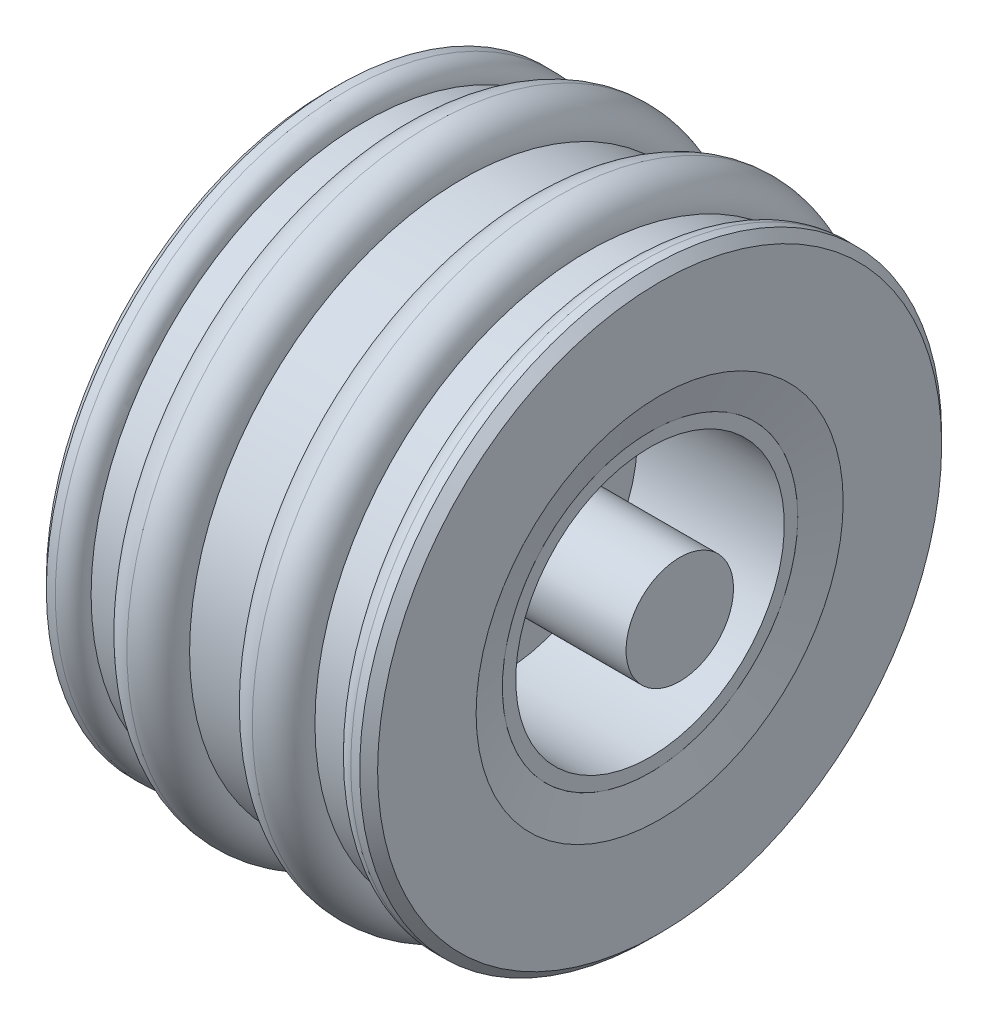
ISO-10303-21;
HEADER;
FILE_DESCRIPTION(('STEP AP214'),'2;1');
FILE_NAME('part.step','',(''),(''),'','','');
FILE_SCHEMA(('AUTOMOTIVE_DESIGN { 1 0 10303 214 1 1 1 1 }'));
ENDSEC;
DATA;
#1=APPLICATION_CONTEXT('core data for automotive mechanical design processes');
#2=APPLICATION_PROTOCOL_DEFINITION('international standard','automotive_design',2000,#1);
#3=PRODUCT_CONTEXT('',#1,'mechanical');
#4=PRODUCT('Part','Part','',(#3));
#5=PRODUCT_RELATED_PRODUCT_CATEGORY('part','',(#4));
#6=PRODUCT_DEFINITION_FORMATION('','',#4);
#7=PRODUCT_DEFINITION_CONTEXT('part definition',#1,'design');
#8=PRODUCT_DEFINITION('design','',#6,#7);
#9=PRODUCT_DEFINITION_SHAPE('','',#8);
#10=(LENGTH_UNIT() NAMED_UNIT(*) SI_UNIT(.MILLI.,.METRE.));
#11=(NAMED_UNIT(*) PLANE_ANGLE_UNIT() SI_UNIT($,.RADIAN.));
#12=(NAMED_UNIT(*) SI_UNIT($,.STERADIAN.) SOLID_ANGLE_UNIT());
#13=UNCERTAINTY_MEASURE_WITH_UNIT(LENGTH_MEASURE(1.E-05),#10,'distance_accuracy_value','');
#14=(GEOMETRIC_REPRESENTATION_CONTEXT(3) GLOBAL_UNCERTAINTY_ASSIGNED_CONTEXT((#13)) GLOBAL_UNIT_ASSIGNED_CONTEXT((#10,
#11,#12)) REPRESENTATION_CONTEXT('',''));
#15=CARTESIAN_POINT('',(0.,0.,0.));
#16=DIRECTION('',(0.,0.,1.));
#17=DIRECTION('',(1.,0.,0.));
#18=AXIS2_PLACEMENT_3D('',#15,#16,#17);
#19=CARTESIAN_POINT('',(174.282032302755,150.,0.));
#20=DIRECTION('',(-1.,0.,0.));
#21=DIRECTION('',(0.,-1.,0.));
#22=AXIS2_PLACEMENT_3D('',#19,#20,#21);
#23=PLANE('',#22);
#24=CARTESIAN_POINT('',(174.282032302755,0.,0.));
#25=DIRECTION('',(-1.,0.,0.));
#26=DIRECTION('',(0.,-1.,0.));
#27=AXIS2_PLACEMENT_3D('',#24,#25,#26);
#28=CIRCLE('',#27,165.);
#29=CARTESIAN_POINT('',(174.282032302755,-165.,0.));
#30=VERTEX_POINT('',#29);
#31=EDGE_CURVE('E63',#30,#30,#28,.T.);
#32=ORIENTED_EDGE('',*,*,#31,.F.);
#33=EDGE_LOOP('',(#32));
#34=FACE_BOUND('',#33,.T.);
#35=CARTESIAN_POINT('',(174.282032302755,0.,0.));
#36=DIRECTION('',(-1.,0.,0.));
#37=DIRECTION('',(0.,-1.,0.));
#38=AXIS2_PLACEMENT_3D('',#35,#36,#37);
#39=CIRCLE('',#38,150.);
#40=CARTESIAN_POINT('',(174.282032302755,-150.,0.));
#41=VERTEX_POINT('',#40);
#42=EDGE_CURVE('E58',#41,#41,#39,.T.);
#43=ORIENTED_EDGE('',*,*,#42,.T.);
#44=EDGE_LOOP('',(#43));
#45=FACE_BOUND('',#44,.T.);
#46=ADVANCED_FACE('F47',(#34,#45),#23,.F.);
#47=CARTESIAN_POINT('',(-10.,0.,0.));
#48=DIRECTION('',(-1.,0.,0.));
#49=DIRECTION('',(0.,-1.,0.));
#50=AXIS2_PLACEMENT_3D('',#47,#48,#49);
#51=CYLINDRICAL_SURFACE('',#50,150.);
#52=ORIENTED_EDGE('',*,*,#42,.F.);
#53=EDGE_LOOP('',(#52));
#54=FACE_BOUND('',#53,.T.);
#55=CARTESIAN_POINT('',(9.99999999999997,0.,0.));
#56=DIRECTION('',(-1.,0.,0.));
#57=DIRECTION('',(0.,-1.,0.));
#58=AXIS2_PLACEMENT_3D('',#55,#56,#57);
#59=CIRCLE('',#58,150.);
#60=CARTESIAN_POINT('',(10.,-150.,0.));
#61=VERTEX_POINT('',#60);
#62=EDGE_CURVE('E76',#61,#61,#59,.T.);
#63=ORIENTED_EDGE('',*,*,#62,.T.);
#64=EDGE_LOOP('',(#63));
#65=FACE_BOUND('',#64,.T.);
#66=ADVANCED_FACE('F82',(#54,#65),#51,.F.);
#67=CARTESIAN_POINT('',(9.99999999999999,0.,0.));
#68=DIRECTION('',(-1.,0.,0.));
#69=DIRECTION('',(0.,-1.,0.));
#70=AXIS2_PLACEMENT_3D('',#67,#68,#69);
#71=PLANE('',#70);
#72=CARTESIAN_POINT('',(9.99999999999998,0.,0.));
#73=DIRECTION('',(-1.,0.,0.));
#74=DIRECTION('',(0.,-1.,0.));
#75=AXIS2_PLACEMENT_3D('',#72,#73,#74);
#76=CIRCLE('',#75,60.);
#77=CARTESIAN_POINT('',(9.99999999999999,-60.,0.));
#78=VERTEX_POINT('',#77);
#79=EDGE_CURVE('E11',#78,#78,#76,.F.);
#80=ORIENTED_EDGE('',*,*,#79,.F.);
#81=EDGE_LOOP('',(#80));
#82=FACE_BOUND('',#81,.T.);
#83=ORIENTED_EDGE('',*,*,#62,.F.);
#84=EDGE_LOOP('',(#83));
#85=FACE_BOUND('',#84,.T.);
#86=ADVANCED_FACE('F85',(#82,#85),#71,.F.);
#87=CARTESIAN_POINT('',(-9.99999999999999,0.,0.));
#88=DIRECTION('',(1.,0.,0.));
#89=DIRECTION('',(0.,1.,0.));
#90=AXIS2_PLACEMENT_3D('',#87,#88,#89);
#91=PLANE('',#90);
#92=CARTESIAN_POINT('',(-9.99999999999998,0.,0.));
#93=DIRECTION('',(1.,0.,0.));
#94=DIRECTION('',(0.,1.,0.));
#95=AXIS2_PLACEMENT_3D('',#92,#93,#94);
#96=CIRCLE('',#95,60.);
#97=CARTESIAN_POINT('',(-9.99999999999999,60.,0.));
#98=VERTEX_POINT('',#97);
#99=EDGE_CURVE('E50',#98,#98,#96,.F.);
#100=ORIENTED_EDGE('',*,*,#99,.F.);
#101=EDGE_LOOP('',(#100));
#102=FACE_BOUND('',#101,.T.);
#103=CARTESIAN_POINT('',(-9.99999999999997,0.,0.));
#104=DIRECTION('',(-1.,0.,0.));
#105=DIRECTION('',(0.,-1.,0.));
#106=AXIS2_PLACEMENT_3D('',#103,#104,#105);
#107=CIRCLE('',#106,150.);
#108=CARTESIAN_POINT('',(-9.99999999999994,-150.,0.));
#109=VERTEX_POINT('',#108);
#110=EDGE_CURVE('E73',#109,#109,#107,.T.);
#111=ORIENTED_EDGE('',*,*,#110,.T.);
#112=EDGE_LOOP('',(#111));
#113=FACE_BOUND('',#112,.T.);
#114=ADVANCED_FACE('F89',(#102,#113),#91,.F.);
#115=CARTESIAN_POINT('',(-10.,0.,0.));
#116=DIRECTION('',(-1.,0.,0.));
#117=DIRECTION('',(0.,-1.,0.));
#118=AXIS2_PLACEMENT_3D('',#115,#116,#117);
#119=CYLINDRICAL_SURFACE('',#118,150.);
#120=ORIENTED_EDGE('',*,*,#110,.F.);
#121=EDGE_LOOP('',(#120));
#122=FACE_BOUND('',#121,.T.);
#123=CARTESIAN_POINT('',(-174.282032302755,0.,0.));
#124=DIRECTION('',(-1.,0.,0.));
#125=DIRECTION('',(0.,-1.,0.));
#126=AXIS2_PLACEMENT_3D('',#123,#124,#125);
#127=CIRCLE('',#126,150.);
#128=CARTESIAN_POINT('',(-174.282032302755,-150.,0.));
#129=VERTEX_POINT('',#128);
#130=EDGE_CURVE('E70',#129,#129,#127,.T.);
#131=ORIENTED_EDGE('',*,*,#130,.T.);
#132=EDGE_LOOP('',(#131));
#133=FACE_BOUND('',#132,.T.);
#134=ADVANCED_FACE('F95',(#122,#133),#119,.F.);
#135=CARTESIAN_POINT('',(-174.282032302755,150.,0.));
#136=DIRECTION('',(1.,0.,0.));
#137=DIRECTION('',(0.,1.,0.));
#138=AXIS2_PLACEMENT_3D('',#135,#136,#137);
#139=PLANE('',#138);
#140=ORIENTED_EDGE('',*,*,#130,.F.);
#141=EDGE_LOOP('',(#140));
#142=FACE_BOUND('',#141,.T.);
#143=CARTESIAN_POINT('',(-174.282032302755,0.,0.));
#144=DIRECTION('',(-1.,0.,0.));
#145=DIRECTION('',(0.,-1.,0.));
#146=AXIS2_PLACEMENT_3D('',#143,#144,#145);
#147=CIRCLE('',#146,165.);
#148=CARTESIAN_POINT('',(-174.282032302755,-165.,0.));
#149=VERTEX_POINT('',#148);
#150=EDGE_CURVE('E66',#149,#149,#147,.T.);
#151=ORIENTED_EDGE('',*,*,#150,.T.);
#152=EDGE_LOOP('',(#151));
#153=FACE_BOUND('',#152,.T.);
#154=ADVANCED_FACE('F107',(#142,#153),#139,.F.);
#155=CARTESIAN_POINT('',(-10.,0.,0.));
#156=DIRECTION('',(-1.,0.,0.));
#157=DIRECTION('',(0.,-1.,0.));
#158=AXIS2_PLACEMENT_3D('',#155,#156,#157);
#159=CYLINDRICAL_SURFACE('',#158,165.);
#160=ORIENTED_EDGE('',*,*,#150,.F.);
#161=EDGE_LOOP('',(#160));
#162=FACE_BOUND('',#161,.T.);
#163=ORIENTED_EDGE('',*,*,#31,.T.);
#164=EDGE_LOOP('',(#163));
#165=FACE_BOUND('',#164,.T.);
#166=ADVANCED_FACE('F104',(#162,#165),#159,.T.);
#167=CARTESIAN_POINT('',(-207.5,0.,0.));
#168=DIRECTION('',(1.,0.,0.));
#169=DIRECTION('',(0.,0.,-1.));
#170=AXIS2_PLACEMENT_3D('',#167,#168,#169);
#171=PLANE('',#170);
#172=CARTESIAN_POINT('',(-207.5,0.,0.));
#173=DIRECTION('',(1.,0.,0.));
#174=DIRECTION('',(0.,0.,-1.));
#175=AXIS2_PLACEMENT_3D('',#172,#173,#174);
#176=CIRCLE('',#175,60.);
#177=CARTESIAN_POINT('',(-207.5,0.,-60.));
#178=VERTEX_POINT('',#177);
#179=EDGE_CURVE('E61',#178,#178,#176,.T.);
#180=ORIENTED_EDGE('',*,*,#179,.F.);
#181=EDGE_LOOP('',(#180));
#182=FACE_BOUND('',#181,.T.);
#183=ADVANCED_FACE('F106',(#182),#171,.F.);
#184=CARTESIAN_POINT('',(207.5,0.,0.));
#185=DIRECTION('',(-1.,0.,0.));
#186=DIRECTION('',(0.,0.,1.));
#187=AXIS2_PLACEMENT_3D('',#184,#185,#186);
#188=CYLINDRICAL_SURFACE('',#187,60.);
#189=ORIENTED_EDGE('',*,*,#179,.T.);
#190=EDGE_LOOP('',(#189));
#191=FACE_BOUND('',#190,.T.);
#192=ORIENTED_EDGE('',*,*,#99,.T.);
#193=EDGE_LOOP('',(#192));
#194=FACE_BOUND('',#193,.T.);
#195=ADVANCED_FACE('F114',(#191,#194),#188,.T.);
#196=CARTESIAN_POINT('',(207.5,0.,0.));
#197=DIRECTION('',(1.,0.,0.));
#198=DIRECTION('',(0.,0.,-1.));
#199=AXIS2_PLACEMENT_3D('',#196,#197,#198);
#200=CIRCLE('',#199,60.);
#201=CARTESIAN_POINT('',(207.5,0.,-60.));
#202=VERTEX_POINT('',#201);
#203=EDGE_CURVE('E67',#202,#202,#200,.T.);
#204=ORIENTED_EDGE('',*,*,#203,.F.);
#205=EDGE_LOOP('',(#204));
#206=FACE_BOUND('',#205,.T.);
#207=ORIENTED_EDGE('',*,*,#79,.T.);
#208=EDGE_LOOP('',(#207));
#209=FACE_BOUND('',#208,.T.);
#210=ADVANCED_FACE('F121',(#206,#209),#188,.T.);
#211=CARTESIAN_POINT('',(207.5,0.,0.));
#212=DIRECTION('',(1.,0.,0.));
#213=DIRECTION('',(0.,0.,-1.));
#214=AXIS2_PLACEMENT_3D('',#211,#212,#213);
#215=PLANE('',#214);
#216=ORIENTED_EDGE('',*,*,#203,.T.);
#217=EDGE_LOOP('',(#216));
#218=FACE_BOUND('',#217,.T.);
#219=ADVANCED_FACE('F181',(#218),#215,.T.);
#220=CLOSED_SHELL('',(#46,#66,#86,#114,#134,#154,#166,#183,#195,#210,#219));
#221=MANIFOLD_SOLID_BREP('B2',#220);
#222=CARTESIAN_POINT('',(0.,0.,0.));
#223=DIRECTION('',(1.,0.,0.));
#224=DIRECTION('',(0.,0.,-1.));
#225=AXIS2_PLACEMENT_3D('',#222,#223,#224);
#226=CYLINDRICAL_SURFACE('',#225,305.);
#227=CARTESIAN_POINT('',(-145.,0.,0.));
#228=DIRECTION('',(1.,0.,0.));
#229=DIRECTION('',(0.,0.,-1.));
#230=AXIS2_PLACEMENT_3D('',#227,#228,#229);
#231=CIRCLE('',#230,305.);
#232=CARTESIAN_POINT('',(-145.,0.,-305.));
#233=VERTEX_POINT('',#232);
#234=EDGE_CURVE('E279',#233,#233,#231,.T.);
#235=ORIENTED_EDGE('',*,*,#234,.T.);
#236=EDGE_LOOP('',(#235));
#237=FACE_BOUND('',#236,.T.);
#238=CARTESIAN_POINT('',(-105.,0.,0.));
#239=DIRECTION('',(1.,0.,0.));
#240=DIRECTION('',(0.,0.,-1.));
#241=AXIS2_PLACEMENT_3D('',#238,#239,#240);
#242=CIRCLE('',#241,305.);
#243=CARTESIAN_POINT('',(-105.,0.,-305.));
#244=VERTEX_POINT('',#243);
#245=EDGE_CURVE('E276',#244,#244,#242,.T.);
#246=ORIENTED_EDGE('',*,*,#245,.F.);
#247=EDGE_LOOP('',(#246));
#248=FACE_BOUND('',#247,.T.);
#249=ADVANCED_FACE('F230',(#237,#248),#226,.T.);
#250=CARTESIAN_POINT('',(0.,0.,0.));
#251=DIRECTION('',(1.,0.,0.));
#252=DIRECTION('',(0.,0.,-1.));
#253=AXIS2_PLACEMENT_3D('',#250,#251,#252);
#254=CYLINDRICAL_SURFACE('',#253,325.);
#255=CARTESIAN_POINT('',(-165.,0.,0.));
#256=DIRECTION('',(1.,0.,0.));
#257=DIRECTION('',(0.,0.,-1.));
#258=AXIS2_PLACEMENT_3D('',#255,#256,#257);
#259=CIRCLE('',#258,325.);
#260=CARTESIAN_POINT('',(-165.,0.,-325.));
#261=VERTEX_POINT('',#260);
#262=EDGE_CURVE('E238',#261,#261,#259,.F.);
#263=ORIENTED_EDGE('',*,*,#262,.T.);
#264=EDGE_LOOP('',(#263));
#265=FACE_BOUND('',#264,.T.);
#266=CARTESIAN_POINT('',(-175.,0.,0.));
#267=DIRECTION('',(-1.,0.,0.));
#268=DIRECTION('',(0.,0.,1.));
#269=AXIS2_PLACEMENT_3D('',#266,#267,#268);
#270=CIRCLE('',#269,325.);
#271=CARTESIAN_POINT('',(-175.,0.,325.));
#272=VERTEX_POINT('',#271);
#273=EDGE_CURVE('E261',#272,#272,#270,.F.);
#274=ORIENTED_EDGE('',*,*,#273,.T.);
#275=EDGE_LOOP('',(#274));
#276=FACE_BOUND('',#275,.T.);
#277=ADVANCED_FACE('F355',(#265,#276),#254,.T.);
#278=CARTESIAN_POINT('',(-185.,165.,0.));
#279=DIRECTION('',(-1.,0.,0.));
#280=DIRECTION('',(0.,0.,1.));
#281=AXIS2_PLACEMENT_3D('',#278,#279,#280);
#282=PLANE('',#281);
#283=CARTESIAN_POINT('',(-185.,0.,0.));
#284=DIRECTION('',(-1.,0.,0.));
#285=DIRECTION('',(0.,0.,1.));
#286=AXIS2_PLACEMENT_3D('',#283,#284,#285);
#287=CIRCLE('',#286,315.);
#288=CARTESIAN_POINT('',(-185.,0.,315.));
#289=VERTEX_POINT('',#288);
#290=EDGE_CURVE('E258',#289,#289,#287,.T.);
#291=ORIENTED_EDGE('',*,*,#290,.T.);
#292=EDGE_LOOP('',(#291));
#293=FACE_BOUND('',#292,.T.);
#294=CARTESIAN_POINT('',(-185.,0.,0.));
#295=DIRECTION('',(-1.,0.,0.));
#296=DIRECTION('',(0.,0.,1.));
#297=AXIS2_PLACEMENT_3D('',#294,#295,#296);
#298=CIRCLE('',#297,205.);
#299=CARTESIAN_POINT('',(-185.,0.,205.));
#300=VERTEX_POINT('',#299);
#301=EDGE_CURVE('E273',#300,#300,#298,.F.);
#302=ORIENTED_EDGE('',*,*,#301,.T.);
#303=EDGE_LOOP('',(#302));
#304=FACE_BOUND('',#303,.T.);
#305=ADVANCED_FACE('F351',(#293,#304),#282,.T.);
#306=CARTESIAN_POINT('',(0.,0.,0.));
#307=DIRECTION('',(1.,0.,0.));
#308=DIRECTION('',(0.,0.,-1.));
#309=AXIS2_PLACEMENT_3D('',#306,#307,#308);
#310=CYLINDRICAL_SURFACE('',#309,165.);
#311=CARTESIAN_POINT('',(-174.282032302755,0.,0.));
#312=DIRECTION('',(-1.,0.,0.));
#313=DIRECTION('',(0.,0.,1.));
#314=AXIS2_PLACEMENT_3D('',#311,#312,#313);
#315=CIRCLE('',#314,165.);
#316=CARTESIAN_POINT('',(-174.282032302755,0.,165.));
#317=VERTEX_POINT('',#316);
#318=EDGE_CURVE('E267',#317,#317,#315,.T.);
#319=ORIENTED_EDGE('',*,*,#318,.T.);
#320=EDGE_LOOP('',(#319));
#321=FACE_BOUND('',#320,.T.);
#322=CARTESIAN_POINT('',(174.282032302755,0.,0.));
#323=DIRECTION('',(1.,0.,0.));
#324=DIRECTION('',(0.,0.,-1.));
#325=AXIS2_PLACEMENT_3D('',#322,#323,#324);
#326=CIRCLE('',#325,165.);
#327=CARTESIAN_POINT('',(174.282032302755,0.,-165.));
#328=VERTEX_POINT('',#327);
#329=EDGE_CURVE('E270',#328,#328,#326,.T.);
#330=ORIENTED_EDGE('',*,*,#329,.T.);
#331=EDGE_LOOP('',(#330));
#332=FACE_BOUND('',#331,.T.);
#333=ADVANCED_FACE('F347',(#321,#332),#310,.F.);
#334=CARTESIAN_POINT('',(185.,325.,0.));
#335=DIRECTION('',(1.,0.,0.));
#336=DIRECTION('',(0.,0.,-1.));
#337=AXIS2_PLACEMENT_3D('',#334,#335,#336);
#338=PLANE('',#337);
#339=CARTESIAN_POINT('',(185.,0.,0.));
#340=DIRECTION('',(1.,0.,0.));
#341=DIRECTION('',(0.,0.,-1.));
#342=AXIS2_PLACEMENT_3D('',#339,#340,#341);
#343=CIRCLE('',#342,315.);
#344=CARTESIAN_POINT('',(185.,0.,-315.));
#345=VERTEX_POINT('',#344);
#346=EDGE_CURVE('E246',#345,#345,#343,.T.);
#347=ORIENTED_EDGE('',*,*,#346,.T.);
#348=EDGE_LOOP('',(#347));
#349=FACE_BOUND('',#348,.T.);
#350=CARTESIAN_POINT('',(185.,0.,0.));
#351=DIRECTION('',(1.,0.,0.));
#352=DIRECTION('',(0.,0.,-1.));
#353=AXIS2_PLACEMENT_3D('',#350,#351,#352);
#354=CIRCLE('',#353,205.);
#355=CARTESIAN_POINT('',(185.,0.,-205.));
#356=VERTEX_POINT('',#355);
#357=EDGE_CURVE('E264',#356,#356,#354,.F.);
#358=ORIENTED_EDGE('',*,*,#357,.T.);
#359=EDGE_LOOP('',(#358));
#360=FACE_BOUND('',#359,.T.);
#361=ADVANCED_FACE('F344',(#349,#360),#338,.T.);
#362=CARTESIAN_POINT('',(0.,0.,0.));
#363=DIRECTION('',(1.,0.,0.));
#364=DIRECTION('',(0.,0.,-1.));
#365=AXIS2_PLACEMENT_3D('',#362,#363,#364);
#366=CYLINDRICAL_SURFACE('',#365,325.);
#367=CARTESIAN_POINT('',(165.,0.,0.));
#368=DIRECTION('',(-1.,0.,0.));
#369=DIRECTION('',(0.,0.,1.));
#370=AXIS2_PLACEMENT_3D('',#367,#368,#369);
#371=CIRCLE('',#370,325.);
#372=CARTESIAN_POINT('',(165.,0.,325.));
#373=VERTEX_POINT('',#372);
#374=EDGE_CURVE('E46',#373,#373,#371,.F.);
#375=ORIENTED_EDGE('',*,*,#374,.T.);
#376=EDGE_LOOP('',(#375));
#377=FACE_BOUND('',#376,.T.);
#378=CARTESIAN_POINT('',(175.,0.,0.));
#379=DIRECTION('',(1.,0.,0.));
#380=DIRECTION('',(0.,0.,-1.));
#381=AXIS2_PLACEMENT_3D('',#378,#379,#380);
#382=CIRCLE('',#381,325.);
#383=CARTESIAN_POINT('',(175.,0.,-325.));
#384=VERTEX_POINT('',#383);
#385=EDGE_CURVE('E242',#384,#384,#382,.F.);
#386=ORIENTED_EDGE('',*,*,#385,.T.);
#387=EDGE_LOOP('',(#386));
#388=FACE_BOUND('',#387,.T.);
#389=ADVANCED_FACE('F340',(#377,#388),#366,.T.);
#390=CARTESIAN_POINT('',(0.,0.,0.));
#391=DIRECTION('',(1.,0.,0.));
#392=DIRECTION('',(0.,0.,-1.));
#393=AXIS2_PLACEMENT_3D('',#390,#391,#392);
#394=CYLINDRICAL_SURFACE('',#393,305.);
#395=CARTESIAN_POINT('',(105.,0.,0.));
#396=DIRECTION('',(1.,0.,0.));
#397=DIRECTION('',(0.,0.,-1.));
#398=AXIS2_PLACEMENT_3D('',#395,#396,#397);
#399=CIRCLE('',#398,305.);
#400=CARTESIAN_POINT('',(105.,0.,-305.));
#401=VERTEX_POINT('',#400);
#402=EDGE_CURVE('E285',#401,#401,#399,.T.);
#403=ORIENTED_EDGE('',*,*,#402,.T.);
#404=EDGE_LOOP('',(#403));
#405=FACE_BOUND('',#404,.T.);
#406=CARTESIAN_POINT('',(145.,0.,0.));
#407=DIRECTION('',(1.,0.,0.));
#408=DIRECTION('',(0.,0.,-1.));
#409=AXIS2_PLACEMENT_3D('',#406,#407,#408);
#410=CIRCLE('',#409,305.);
#411=CARTESIAN_POINT('',(145.,0.,-305.));
#412=VERTEX_POINT('',#411);
#413=EDGE_CURVE('E282',#412,#412,#410,.T.);
#414=ORIENTED_EDGE('',*,*,#413,.F.);
#415=EDGE_LOOP('',(#414));
#416=FACE_BOUND('',#415,.T.);
#417=ADVANCED_FACE('F336',(#405,#416),#394,.T.);
#418=CARTESIAN_POINT('',(0.,0.,0.));
#419=DIRECTION('',(1.,0.,0.));
#420=DIRECTION('',(0.,0.,-1.));
#421=AXIS2_PLACEMENT_3D('',#418,#419,#420);
#422=CYLINDRICAL_SURFACE('',#421,305.);
#423=CARTESIAN_POINT('',(-35.0000000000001,0.,0.));
#424=DIRECTION('',(1.,0.,0.));
#425=DIRECTION('',(0.,0.,-1.));
#426=AXIS2_PLACEMENT_3D('',#423,#424,#425);
#427=CIRCLE('',#426,305.);
#428=CARTESIAN_POINT('',(-35.0000000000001,0.,-305.));
#429=VERTEX_POINT('',#428);
#430=EDGE_CURVE('E291',#429,#429,#427,.T.);
#431=ORIENTED_EDGE('',*,*,#430,.T.);
#432=EDGE_LOOP('',(#431));
#433=FACE_BOUND('',#432,.T.);
#434=CARTESIAN_POINT('',(35.,0.,0.));
#435=DIRECTION('',(1.,0.,0.));
#436=DIRECTION('',(0.,0.,-1.));
#437=AXIS2_PLACEMENT_3D('',#434,#435,#436);
#438=CIRCLE('',#437,305.);
#439=CARTESIAN_POINT('',(35.,0.,-305.));
#440=VERTEX_POINT('',#439);
#441=EDGE_CURVE('E288',#440,#440,#438,.T.);
#442=ORIENTED_EDGE('',*,*,#441,.F.);
#443=EDGE_LOOP('',(#442));
#444=FACE_BOUND('',#443,.T.);
#445=ADVANCED_FACE('F332',(#433,#444),#422,.T.);
#446=CARTESIAN_POINT('',(-185.,0.,0.));
#447=DIRECTION('',(-1.,0.,0.));
#448=DIRECTION('',(0.,0.,1.));
#449=AXIS2_PLACEMENT_3D('',#446,#447,#448);
#450=CONICAL_SURFACE('',#449,205.,1.30899693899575);
#451=ORIENTED_EDGE('',*,*,#318,.F.);
#452=EDGE_LOOP('',(#451));
#453=FACE_BOUND('',#452,.T.);
#454=ORIENTED_EDGE('',*,*,#301,.F.);
#455=EDGE_LOOP('',(#454));
#456=FACE_BOUND('',#455,.T.);
#457=ADVANCED_FACE('F335',(#453,#456),#450,.F.);
#458=CARTESIAN_POINT('',(174.282032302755,0.,0.));
#459=DIRECTION('',(1.,0.,0.));
#460=DIRECTION('',(0.,0.,-1.));
#461=AXIS2_PLACEMENT_3D('',#458,#459,#460);
#462=CONICAL_SURFACE('',#461,165.,1.30899693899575);
#463=ORIENTED_EDGE('',*,*,#357,.F.);
#464=EDGE_LOOP('',(#463));
#465=FACE_BOUND('',#464,.T.);
#466=ORIENTED_EDGE('',*,*,#329,.F.);
#467=EDGE_LOOP('',(#466));
#468=FACE_BOUND('',#467,.T.);
#469=ADVANCED_FACE('F368',(#465,#468),#462,.F.);
#470=CARTESIAN_POINT('',(-175.,0.,0.));
#471=DIRECTION('',(1.,0.,0.));
#472=DIRECTION('',(0.,0.,-1.));
#473=AXIS2_PLACEMENT_3D('',#470,#471,#472);
#474=CONICAL_SURFACE('',#473,325.,0.785398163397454);
#475=ORIENTED_EDGE('',*,*,#290,.F.);
#476=EDGE_LOOP('',(#475));
#477=FACE_BOUND('',#476,.T.);
#478=ORIENTED_EDGE('',*,*,#273,.F.);
#479=EDGE_LOOP('',(#478));
#480=FACE_BOUND('',#479,.T.);
#481=ADVANCED_FACE('F375',(#477,#480),#474,.T.);
#482=CARTESIAN_POINT('',(185.,0.,0.));
#483=DIRECTION('',(-1.,0.,0.));
#484=DIRECTION('',(0.,0.,1.));
#485=AXIS2_PLACEMENT_3D('',#482,#483,#484);
#486=CONICAL_SURFACE('',#485,315.,0.785398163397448);
#487=ORIENTED_EDGE('',*,*,#385,.F.);
#488=EDGE_LOOP('',(#487));
#489=FACE_BOUND('',#488,.T.);
#490=ORIENTED_EDGE('',*,*,#346,.F.);
#491=EDGE_LOOP('',(#490));
#492=FACE_BOUND('',#491,.T.);
#493=ADVANCED_FACE('F382',(#489,#492),#486,.T.);
#494=CARTESIAN_POINT('',(-70.0000000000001,0.,0.));
#495=DIRECTION('',(1.,0.,0.));
#496=DIRECTION('',(0.,0.,-1.));
#497=AXIS2_PLACEMENT_3D('',#494,#495,#496);
#498=TOROIDAL_SURFACE('',#497,305.,35.);
#499=ORIENTED_EDGE('',*,*,#430,.F.);
#500=EDGE_LOOP('',(#499));
#501=FACE_BOUND('',#500,.T.);
#502=CARTESIAN_POINT('',(-70.0000000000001,0.,0.));
#503=DIRECTION('',(1.,0.,0.));
#504=DIRECTION('',(0.,0.,-1.));
#505=AXIS2_PLACEMENT_3D('',#502,#503,#504);
#506=CIRCLE('',#505,340.);
#507=CARTESIAN_POINT('',(-70.0000000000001,0.,-340.));
#508=VERTEX_POINT('',#507);
#509=EDGE_CURVE('E252',#508,#508,#506,.F.);
#510=ORIENTED_EDGE('',*,*,#509,.F.);
#511=EDGE_LOOP('',(#510));
#512=FACE_BOUND('',#511,.T.);
#513=ADVANCED_FACE('F388',(#501,#512),#498,.T.);
#514=CARTESIAN_POINT('',(-70.0000000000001,0.,0.));
#515=DIRECTION('',(-1.,0.,0.));
#516=DIRECTION('',(0.,0.,1.));
#517=AXIS2_PLACEMENT_3D('',#514,#515,#516);
#518=TOROIDAL_SURFACE('',#517,305.,35.);
#519=ORIENTED_EDGE('',*,*,#245,.T.);
#520=EDGE_LOOP('',(#519));
#521=FACE_BOUND('',#520,.T.);
#522=ORIENTED_EDGE('',*,*,#509,.T.);
#523=EDGE_LOOP('',(#522));
#524=FACE_BOUND('',#523,.T.);
#525=ADVANCED_FACE('F390',(#521,#524),#518,.T.);
#526=CARTESIAN_POINT('',(70.,0.,0.));
#527=DIRECTION('',(-1.,0.,0.));
#528=DIRECTION('',(0.,0.,1.));
#529=AXIS2_PLACEMENT_3D('',#526,#527,#528);
#530=TOROIDAL_SURFACE('',#529,305.,35.);
#531=ORIENTED_EDGE('',*,*,#441,.T.);
#532=EDGE_LOOP('',(#531));
#533=FACE_BOUND('',#532,.T.);
#534=CARTESIAN_POINT('',(70.,0.,0.));
#535=DIRECTION('',(-1.,0.,0.));
#536=DIRECTION('',(0.,0.,1.));
#537=AXIS2_PLACEMENT_3D('',#534,#535,#536);
#538=CIRCLE('',#537,340.);
#539=CARTESIAN_POINT('',(70.,0.,340.));
#540=VERTEX_POINT('',#539);
#541=EDGE_CURVE('E249',#540,#540,#538,.F.);
#542=ORIENTED_EDGE('',*,*,#541,.F.);
#543=EDGE_LOOP('',(#542));
#544=FACE_BOUND('',#543,.T.);
#545=ADVANCED_FACE('F393',(#533,#544),#530,.T.);
#546=CARTESIAN_POINT('',(70.,0.,0.));
#547=DIRECTION('',(1.,0.,0.));
#548=DIRECTION('',(0.,0.,-1.));
#549=AXIS2_PLACEMENT_3D('',#546,#547,#548);
#550=TOROIDAL_SURFACE('',#549,305.,35.);
#551=ORIENTED_EDGE('',*,*,#541,.T.);
#552=EDGE_LOOP('',(#551));
#553=FACE_BOUND('',#552,.T.);
#554=ORIENTED_EDGE('',*,*,#402,.F.);
#555=EDGE_LOOP('',(#554));
#556=FACE_BOUND('',#555,.T.);
#557=ADVANCED_FACE('F398',(#553,#556),#550,.T.);
#558=CARTESIAN_POINT('',(-165.,0.,0.));
#559=DIRECTION('',(1.,0.,0.));
#560=DIRECTION('',(0.,0.,-1.));
#561=AXIS2_PLACEMENT_3D('',#558,#559,#560);
#562=TOROIDAL_SURFACE('',#561,305.,20.);
#563=ORIENTED_EDGE('',*,*,#262,.F.);
#564=EDGE_LOOP('',(#563));
#565=FACE_BOUND('',#564,.T.);
#566=ORIENTED_EDGE('',*,*,#234,.F.);
#567=EDGE_LOOP('',(#566));
#568=FACE_BOUND('',#567,.T.);
#569=ADVANCED_FACE('F401',(#565,#568),#562,.T.);
#570=CARTESIAN_POINT('',(165.,0.,0.));
#571=DIRECTION('',(-1.,0.,0.));
#572=DIRECTION('',(0.,0.,1.));
#573=AXIS2_PLACEMENT_3D('',#570,#571,#572);
#574=TOROIDAL_SURFACE('',#573,305.,20.);
#575=ORIENTED_EDGE('',*,*,#413,.T.);
#576=EDGE_LOOP('',(#575));
#577=FACE_BOUND('',#576,.T.);
#578=ORIENTED_EDGE('',*,*,#374,.F.);
#579=EDGE_LOOP('',(#578));
#580=FACE_BOUND('',#579,.T.);
#581=ADVANCED_FACE('F232',(#577,#580),#574,.T.);
#582=CLOSED_SHELL('',(#249,#277,#305,#333,#361,#389,#417,#445,#457,#469,#481,#493,#513,#525,
#545,#557,#569,#581));
#583=CARTESIAN_POINT('',(165.,185.,0.));
#584=DIRECTION('',(1.,0.,0.));
#585=DIRECTION('',(0.,0.,-1.));
#586=AXIS2_PLACEMENT_3D('',#583,#584,#585);
#587=PLANE('',#586);
#588=CARTESIAN_POINT('',(165.,0.,0.));
#589=DIRECTION('',(1.,0.,0.));
#590=DIRECTION('',(0.,0.,-1.));
#591=AXIS2_PLACEMENT_3D('',#588,#589,#590);
#592=CIRCLE('',#591,275.);
#593=CARTESIAN_POINT('',(165.,0.,-275.));
#594=VERTEX_POINT('',#593);
#595=EDGE_CURVE('E254',#594,#594,#592,.T.);
#596=ORIENTED_EDGE('',*,*,#595,.F.);
#597=EDGE_LOOP('',(#596));
#598=FACE_BOUND('',#597,.T.);
#599=CARTESIAN_POINT('',(165.,0.,0.));
#600=DIRECTION('',(1.,0.,0.));
#601=DIRECTION('',(0.,0.,-1.));
#602=AXIS2_PLACEMENT_3D('',#599,#600,#601);
#603=CIRCLE('',#602,185.);
#604=CARTESIAN_POINT('',(165.,0.,-185.));
#605=VERTEX_POINT('',#604);
#606=EDGE_CURVE('E294',#605,#605,#603,.T.);
#607=ORIENTED_EDGE('',*,*,#606,.T.);
#608=EDGE_LOOP('',(#607));
#609=FACE_BOUND('',#608,.T.);
#610=ADVANCED_FACE('F308',(#598,#609),#587,.F.);
#611=CARTESIAN_POINT('',(0.,0.,0.));
#612=DIRECTION('',(1.,0.,0.));
#613=DIRECTION('',(0.,0.,-1.));
#614=AXIS2_PLACEMENT_3D('',#611,#612,#613);
#615=CYLINDRICAL_SURFACE('',#614,185.);
#616=ORIENTED_EDGE('',*,*,#606,.F.);
#617=EDGE_LOOP('',(#616));
#618=FACE_BOUND('',#617,.T.);
#619=CARTESIAN_POINT('',(-165.,0.,0.));
#620=DIRECTION('',(1.,0.,0.));
#621=DIRECTION('',(0.,0.,-1.));
#622=AXIS2_PLACEMENT_3D('',#619,#620,#621);
#623=CIRCLE('',#622,185.);
#624=CARTESIAN_POINT('',(-165.,0.,-185.));
#625=VERTEX_POINT('',#624);
#626=EDGE_CURVE('E297',#625,#625,#623,.T.);
#627=ORIENTED_EDGE('',*,*,#626,.T.);
#628=EDGE_LOOP('',(#627));
#629=FACE_BOUND('',#628,.T.);
#630=ADVANCED_FACE('F311',(#618,#629),#615,.T.);
#631=CARTESIAN_POINT('',(-165.,185.,0.));
#632=DIRECTION('',(-1.,0.,0.));
#633=DIRECTION('',(0.,0.,1.));
#634=AXIS2_PLACEMENT_3D('',#631,#632,#633);
#635=PLANE('',#634);
#636=ORIENTED_EDGE('',*,*,#626,.F.);
#637=EDGE_LOOP('',(#636));
#638=FACE_BOUND('',#637,.T.);
#639=CARTESIAN_POINT('',(-165.,0.,0.));
#640=DIRECTION('',(1.,0.,0.));
#641=DIRECTION('',(0.,0.,-1.));
#642=AXIS2_PLACEMENT_3D('',#639,#640,#641);
#643=CIRCLE('',#642,275.);
#644=CARTESIAN_POINT('',(-165.,0.,-275.));
#645=VERTEX_POINT('',#644);
#646=EDGE_CURVE('E300',#645,#645,#643,.T.);
#647=ORIENTED_EDGE('',*,*,#646,.T.);
#648=EDGE_LOOP('',(#647));
#649=FACE_BOUND('',#648,.T.);
#650=ADVANCED_FACE('F318',(#638,#649),#635,.F.);
#651=CARTESIAN_POINT('',(0.,0.,0.));
#652=DIRECTION('',(1.,0.,0.));
#653=DIRECTION('',(0.,0.,-1.));
#654=AXIS2_PLACEMENT_3D('',#651,#652,#653);
#655=CYLINDRICAL_SURFACE('',#654,275.);
#656=ORIENTED_EDGE('',*,*,#646,.F.);
#657=EDGE_LOOP('',(#656));
#658=FACE_BOUND('',#657,.T.);
#659=ORIENTED_EDGE('',*,*,#595,.T.);
#660=EDGE_LOOP('',(#659));
#661=FACE_BOUND('',#660,.T.);
#662=ADVANCED_FACE('F306',(#658,#661),#655,.F.);
#663=CLOSED_SHELL('',(#610,#630,#650,#662));
#664=ORIENTED_CLOSED_SHELL('',*,#663,.T.);
#665=BREP_WITH_VOIDS('B6',#582,(#664));
#666=ADVANCED_BREP_SHAPE_REPRESENTATION('',(#18,#221,#665),#14);
#667=SHAPE_DEFINITION_REPRESENTATION(#9,#666);
ENDSEC;
END-ISO-10303-21;
